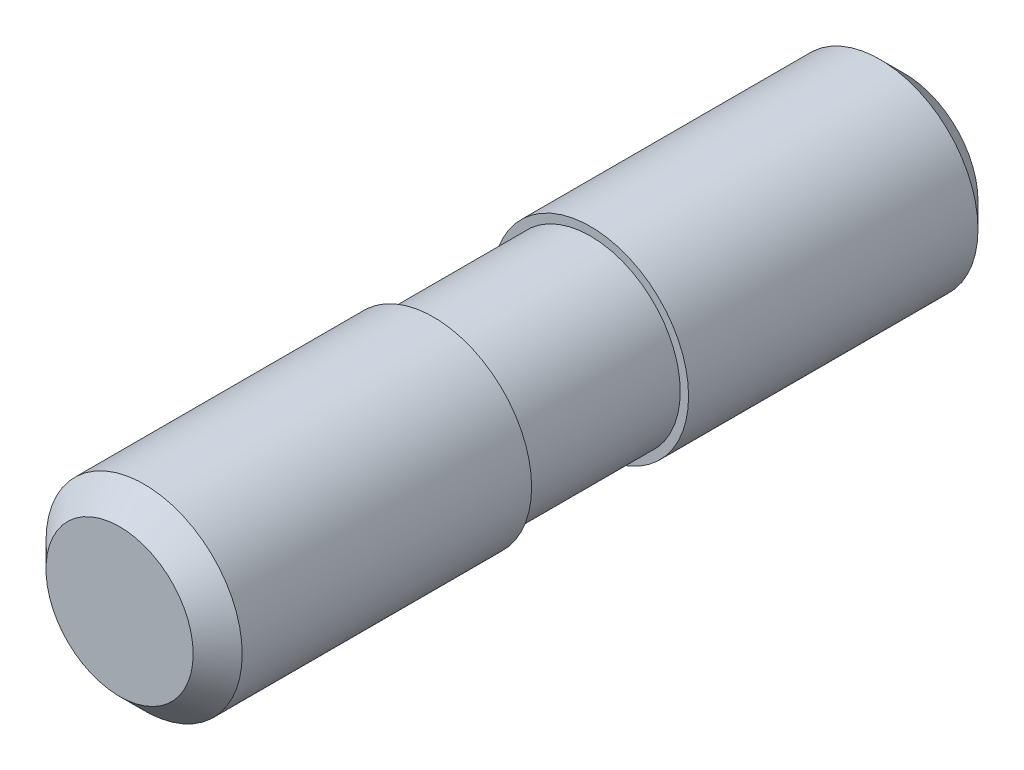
ISO-10303-21;
HEADER;
FILE_DESCRIPTION(('STEP AP214'),'2;1');
FILE_NAME('part.step','',(''),(''),'','','');
FILE_SCHEMA(('AUTOMOTIVE_DESIGN { 1 0 10303 214 1 1 1 1 }'));
ENDSEC;
DATA;
#1=APPLICATION_CONTEXT('core data for automotive mechanical design processes');
#2=APPLICATION_PROTOCOL_DEFINITION('international standard','automotive_design',2000,#1);
#3=PRODUCT_CONTEXT('',#1,'mechanical');
#4=PRODUCT('Part','Part','',(#3));
#5=PRODUCT_RELATED_PRODUCT_CATEGORY('part','',(#4));
#6=PRODUCT_DEFINITION_FORMATION('','',#4);
#7=PRODUCT_DEFINITION_CONTEXT('part definition',#1,'design');
#8=PRODUCT_DEFINITION('design','',#6,#7);
#9=PRODUCT_DEFINITION_SHAPE('','',#8);
#10=(LENGTH_UNIT() NAMED_UNIT(*) SI_UNIT(.MILLI.,.METRE.));
#11=(NAMED_UNIT(*) PLANE_ANGLE_UNIT() SI_UNIT($,.RADIAN.));
#12=(NAMED_UNIT(*) SI_UNIT($,.STERADIAN.) SOLID_ANGLE_UNIT());
#13=UNCERTAINTY_MEASURE_WITH_UNIT(LENGTH_MEASURE(1.E-05),#10,'distance_accuracy_value','');
#14=(GEOMETRIC_REPRESENTATION_CONTEXT(3) GLOBAL_UNCERTAINTY_ASSIGNED_CONTEXT((#13)) GLOBAL_UNIT_ASSIGNED_CONTEXT((#10,
#11,#12)) REPRESENTATION_CONTEXT('',''));
#15=CARTESIAN_POINT('',(0.,0.,0.));
#16=DIRECTION('',(0.,0.,1.));
#17=DIRECTION('',(1.,0.,0.));
#18=AXIS2_PLACEMENT_3D('',#15,#16,#17);
#19=CARTESIAN_POINT('',(0.,0.,0.));
#20=DIRECTION('',(0.,0.,1.));
#21=DIRECTION('',(1.,0.,0.));
#22=AXIS2_PLACEMENT_3D('',#19,#20,#21);
#23=PLANE('',#22);
#24=CARTESIAN_POINT('',(0.,0.,0.));
#25=DIRECTION('',(0.,0.,1.));
#26=DIRECTION('',(1.,0.,0.));
#27=AXIS2_PLACEMENT_3D('',#24,#25,#26);
#28=CIRCLE('',#27,7.5);
#29=CARTESIAN_POINT('',(7.5,0.,0.));
#30=VERTEX_POINT('',#29);
#31=EDGE_CURVE('E8',#30,#30,#28,.T.);
#32=ORIENTED_EDGE('',*,*,#31,.F.);
#33=EDGE_LOOP('',(#32));
#34=FACE_BOUND('',#33,.T.);
#35=ADVANCED_FACE('F12',(#34),#23,.F.);
#36=CARTESIAN_POINT('',(0.,0.,2.5));
#37=DIRECTION('',(0.,0.,1.));
#38=DIRECTION('',(1.,0.,0.));
#39=AXIS2_PLACEMENT_3D('',#36,#37,#38);
#40=CONICAL_SURFACE('',#39,10.,0.785398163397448);
#41=ORIENTED_EDGE('',*,*,#31,.T.);
#42=EDGE_LOOP('',(#41));
#43=FACE_BOUND('',#42,.T.);
#44=CARTESIAN_POINT('',(0.,0.,2.5));
#45=DIRECTION('',(0.,0.,1.));
#46=DIRECTION('',(1.,0.,0.));
#47=AXIS2_PLACEMENT_3D('',#44,#45,#46);
#48=CIRCLE('',#47,10.);
#49=CARTESIAN_POINT('',(10.,0.,2.5));
#50=VERTEX_POINT('',#49);
#51=EDGE_CURVE('E18',#50,#50,#48,.T.);
#52=ORIENTED_EDGE('',*,*,#51,.F.);
#53=EDGE_LOOP('',(#52));
#54=FACE_BOUND('',#53,.T.);
#55=ADVANCED_FACE('F61',(#43,#54),#40,.T.);
#56=CARTESIAN_POINT('',(0.,0.,70.));
#57=DIRECTION('',(0.,0.,1.));
#58=DIRECTION('',(1.,0.,0.));
#59=AXIS2_PLACEMENT_3D('',#56,#57,#58);
#60=CYLINDRICAL_SURFACE('',#59,10.);
#61=CARTESIAN_POINT('',(0.,0.,32.));
#62=DIRECTION('',(0.,0.,1.));
#63=DIRECTION('',(1.,0.,0.));
#64=AXIS2_PLACEMENT_3D('',#61,#62,#63);
#65=CIRCLE('',#64,10.);
#66=CARTESIAN_POINT('',(10.,0.,32.));
#67=VERTEX_POINT('',#66);
#68=EDGE_CURVE('E22',#67,#67,#65,.T.);
#69=ORIENTED_EDGE('',*,*,#68,.F.);
#70=EDGE_LOOP('',(#69));
#71=FACE_BOUND('',#70,.T.);
#72=ORIENTED_EDGE('',*,*,#51,.T.);
#73=EDGE_LOOP('',(#72));
#74=FACE_BOUND('',#73,.T.);
#75=ADVANCED_FACE('F66',(#71,#74),#60,.T.);
#76=CARTESIAN_POINT('',(10.,0.,32.));
#77=DIRECTION('',(0.,0.,-1.));
#78=DIRECTION('',(-1.,0.,0.));
#79=AXIS2_PLACEMENT_3D('',#76,#77,#78);
#80=PLANE('',#79);
#81=CARTESIAN_POINT('',(0.,0.,32.));
#82=DIRECTION('',(0.,0.,1.));
#83=DIRECTION('',(1.,0.,0.));
#84=AXIS2_PLACEMENT_3D('',#81,#82,#83);
#85=CIRCLE('',#84,9.15);
#86=CARTESIAN_POINT('',(9.15,0.,32.));
#87=VERTEX_POINT('',#86);
#88=EDGE_CURVE('E26',#87,#87,#85,.T.);
#89=ORIENTED_EDGE('',*,*,#88,.F.);
#90=EDGE_LOOP('',(#89));
#91=FACE_BOUND('',#90,.T.);
#92=ORIENTED_EDGE('',*,*,#68,.T.);
#93=EDGE_LOOP('',(#92));
#94=FACE_BOUND('',#93,.T.);
#95=ADVANCED_FACE('F70',(#91,#94),#80,.F.);
#96=CARTESIAN_POINT('',(0.,0.,70.));
#97=DIRECTION('',(0.,0.,1.));
#98=DIRECTION('',(1.,0.,0.));
#99=AXIS2_PLACEMENT_3D('',#96,#97,#98);
#100=CYLINDRICAL_SURFACE('',#99,9.15);
#101=CARTESIAN_POINT('',(0.,0.,48.));
#102=DIRECTION('',(0.,0.,1.));
#103=DIRECTION('',(1.,0.,0.));
#104=AXIS2_PLACEMENT_3D('',#101,#102,#103);
#105=CIRCLE('',#104,9.15);
#106=CARTESIAN_POINT('',(9.15,0.,48.));
#107=VERTEX_POINT('',#106);
#108=EDGE_CURVE('E31',#107,#107,#105,.T.);
#109=ORIENTED_EDGE('',*,*,#108,.F.);
#110=EDGE_LOOP('',(#109));
#111=FACE_BOUND('',#110,.T.);
#112=ORIENTED_EDGE('',*,*,#88,.T.);
#113=EDGE_LOOP('',(#112));
#114=FACE_BOUND('',#113,.T.);
#115=ADVANCED_FACE('F77',(#111,#114),#100,.T.);
#116=CARTESIAN_POINT('',(9.15,0.,48.));
#117=DIRECTION('',(0.,0.,1.));
#118=DIRECTION('',(1.,0.,0.));
#119=AXIS2_PLACEMENT_3D('',#116,#117,#118);
#120=PLANE('',#119);
#121=CARTESIAN_POINT('',(0.,0.,48.));
#122=DIRECTION('',(0.,0.,1.));
#123=DIRECTION('',(1.,0.,0.));
#124=AXIS2_PLACEMENT_3D('',#121,#122,#123);
#125=CIRCLE('',#124,10.);
#126=CARTESIAN_POINT('',(10.,0.,48.));
#127=VERTEX_POINT('',#126);
#128=EDGE_CURVE('E34',#127,#127,#125,.T.);
#129=ORIENTED_EDGE('',*,*,#128,.F.);
#130=EDGE_LOOP('',(#129));
#131=FACE_BOUND('',#130,.T.);
#132=ORIENTED_EDGE('',*,*,#108,.T.);
#133=EDGE_LOOP('',(#132));
#134=FACE_BOUND('',#133,.T.);
#135=ADVANCED_FACE('F57',(#131,#134),#120,.F.);
#136=CARTESIAN_POINT('',(0.,0.,70.));
#137=DIRECTION('',(0.,0.,1.));
#138=DIRECTION('',(1.,0.,0.));
#139=AXIS2_PLACEMENT_3D('',#136,#137,#138);
#140=CYLINDRICAL_SURFACE('',#139,10.);
#141=CARTESIAN_POINT('',(0.,0.,77.5));
#142=DIRECTION('',(0.,0.,1.));
#143=DIRECTION('',(1.,0.,0.));
#144=AXIS2_PLACEMENT_3D('',#141,#142,#143);
#145=CIRCLE('',#144,10.);
#146=CARTESIAN_POINT('',(10.,0.,77.5));
#147=VERTEX_POINT('',#146);
#148=EDGE_CURVE('E37',#147,#147,#145,.T.);
#149=ORIENTED_EDGE('',*,*,#148,.F.);
#150=EDGE_LOOP('',(#149));
#151=FACE_BOUND('',#150,.T.);
#152=ORIENTED_EDGE('',*,*,#128,.T.);
#153=EDGE_LOOP('',(#152));
#154=FACE_BOUND('',#153,.T.);
#155=ADVANCED_FACE('F48',(#151,#154),#140,.T.);
#156=CARTESIAN_POINT('',(0.,0.,80.));
#157=DIRECTION('',(0.,0.,-1.));
#158=DIRECTION('',(-1.,0.,0.));
#159=AXIS2_PLACEMENT_3D('',#156,#157,#158);
#160=CONICAL_SURFACE('',#159,7.5,0.785398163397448);
#161=ORIENTED_EDGE('',*,*,#148,.T.);
#162=EDGE_LOOP('',(#161));
#163=FACE_BOUND('',#162,.T.);
#164=CARTESIAN_POINT('',(0.,0.,80.));
#165=DIRECTION('',(0.,0.,1.));
#166=DIRECTION('',(1.,0.,0.));
#167=AXIS2_PLACEMENT_3D('',#164,#165,#166);
#168=CIRCLE('',#167,7.5);
#169=CARTESIAN_POINT('',(7.5,0.,80.));
#170=VERTEX_POINT('',#169);
#171=EDGE_CURVE('E40',#170,#170,#168,.T.);
#172=ORIENTED_EDGE('',*,*,#171,.F.);
#173=EDGE_LOOP('',(#172));
#174=FACE_BOUND('',#173,.T.);
#175=ADVANCED_FACE('F46',(#163,#174),#160,.T.);
#176=CARTESIAN_POINT('',(7.5,0.,80.));
#177=DIRECTION('',(0.,0.,-1.));
#178=DIRECTION('',(-1.,0.,0.));
#179=AXIS2_PLACEMENT_3D('',#176,#177,#178);
#180=PLANE('',#179);
#181=ORIENTED_EDGE('',*,*,#171,.T.);
#182=EDGE_LOOP('',(#181));
#183=FACE_BOUND('',#182,.T.);
#184=ADVANCED_FACE('F44',(#183),#180,.F.);
#185=CLOSED_SHELL('',(#35,#55,#75,#95,#115,#135,#155,#175,#184));
#186=MANIFOLD_SOLID_BREP('B1',#185);
#187=ADVANCED_BREP_SHAPE_REPRESENTATION('',(#18,#186),#14);
#188=SHAPE_DEFINITION_REPRESENTATION(#9,#187);
ENDSEC;
END-ISO-10303-21;
